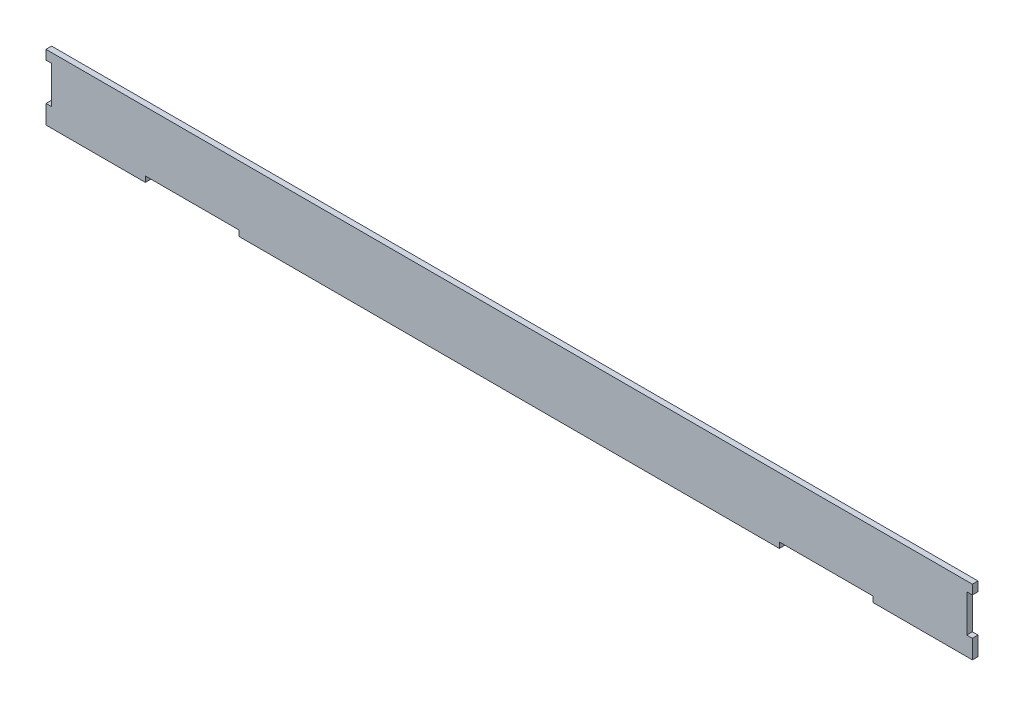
ISO-10303-21;
HEADER;
FILE_DESCRIPTION(('STEP AP214'),'2;1');
FILE_NAME('part.step','',(''),(''),'','','');
FILE_SCHEMA(('AUTOMOTIVE_DESIGN { 1 0 10303 214 1 1 1 1 }'));
ENDSEC;
DATA;
#1=APPLICATION_CONTEXT('core data for automotive mechanical design processes');
#2=APPLICATION_PROTOCOL_DEFINITION('international standard','automotive_design',2000,#1);
#3=PRODUCT_CONTEXT('',#1,'mechanical');
#4=PRODUCT('Part','Part','',(#3));
#5=PRODUCT_RELATED_PRODUCT_CATEGORY('part','',(#4));
#6=PRODUCT_DEFINITION_FORMATION('','',#4);
#7=PRODUCT_DEFINITION_CONTEXT('part definition',#1,'design');
#8=PRODUCT_DEFINITION('design','',#6,#7);
#9=PRODUCT_DEFINITION_SHAPE('','',#8);
#10=(LENGTH_UNIT() NAMED_UNIT(*) SI_UNIT(.MILLI.,.METRE.));
#11=(NAMED_UNIT(*) PLANE_ANGLE_UNIT() SI_UNIT($,.RADIAN.));
#12=(NAMED_UNIT(*) SI_UNIT($,.STERADIAN.) SOLID_ANGLE_UNIT());
#13=UNCERTAINTY_MEASURE_WITH_UNIT(LENGTH_MEASURE(1.E-05),#10,'distance_accuracy_value','');
#14=(GEOMETRIC_REPRESENTATION_CONTEXT(3) GLOBAL_UNCERTAINTY_ASSIGNED_CONTEXT((#13)) GLOBAL_UNIT_ASSIGNED_CONTEXT((#10,
#11,#12)) REPRESENTATION_CONTEXT('',''));
#15=CARTESIAN_POINT('',(0.,0.,0.));
#16=DIRECTION('',(0.,0.,1.));
#17=DIRECTION('',(1.,0.,0.));
#18=AXIS2_PLACEMENT_3D('',#15,#16,#17);
#19=CARTESIAN_POINT('',(0.,0.,3.));
#20=DIRECTION('',(1.,0.,0.));
#21=DIRECTION('',(0.,0.,-1.));
#22=AXIS2_PLACEMENT_3D('',#19,#20,#21);
#23=PLANE('',#22);
#24=DIRECTION('',(0.,-1.,0.));
#25=VECTOR('',#24,1.);
#26=CARTESIAN_POINT('',(0.,0.,0.));
#27=LINE('',#26,#25);
#28=CARTESIAN_POINT('',(0.,10.,0.));
#29=VERTEX_POINT('',#28);
#30=CARTESIAN_POINT('',(0.,0.,0.));
#31=VERTEX_POINT('',#30);
#32=EDGE_CURVE('E216',#29,#31,#27,.T.);
#33=ORIENTED_EDGE('',*,*,#32,.T.);
#34=DIRECTION('',(0.,0.,-1.));
#35=VECTOR('',#34,1.);
#36=CARTESIAN_POINT('',(0.,0.,3.));
#37=LINE('',#36,#35);
#38=CARTESIAN_POINT('',(0.,0.,3.));
#39=VERTEX_POINT('',#38);
#40=EDGE_CURVE('E11',#39,#31,#37,.T.);
#41=ORIENTED_EDGE('',*,*,#40,.F.);
#42=DIRECTION('',(0.,-1.,0.));
#43=VECTOR('',#42,1.);
#44=CARTESIAN_POINT('',(0.,0.,3.));
#45=LINE('',#44,#43);
#46=CARTESIAN_POINT('',(0.,10.,3.));
#47=VERTEX_POINT('',#46);
#48=EDGE_CURVE('E274',#47,#39,#45,.T.);
#49=ORIENTED_EDGE('',*,*,#48,.F.);
#50=DIRECTION('',(0.,0.,-1.));
#51=VECTOR('',#50,1.);
#52=CARTESIAN_POINT('',(0.,10.,3.));
#53=LINE('',#52,#51);
#54=EDGE_CURVE('E212',#47,#29,#53,.T.);
#55=ORIENTED_EDGE('',*,*,#54,.T.);
#56=EDGE_LOOP('',(#33,#41,#49,#55));
#57=FACE_BOUND('',#56,.T.);
#58=ADVANCED_FACE('F43',(#57),#23,.F.);
#59=CARTESIAN_POINT('',(0.,0.,3.));
#60=DIRECTION('',(0.,1.,0.));
#61=DIRECTION('',(0.,0.,1.));
#62=AXIS2_PLACEMENT_3D('',#59,#60,#61);
#63=PLANE('',#62);
#64=DIRECTION('',(1.,0.,0.));
#65=VECTOR('',#64,1.);
#66=CARTESIAN_POINT('',(0.,0.,0.));
#67=LINE('',#66,#65);
#68=CARTESIAN_POINT('',(53.,0.,0.));
#69=VERTEX_POINT('',#68);
#70=EDGE_CURVE('E220',#31,#69,#67,.T.);
#71=ORIENTED_EDGE('',*,*,#70,.T.);
#72=DIRECTION('',(0.,0.,-1.));
#73=VECTOR('',#72,1.);
#74=CARTESIAN_POINT('',(53.,0.,3.));
#75=LINE('',#74,#73);
#76=CARTESIAN_POINT('',(53.,0.,3.));
#77=VERTEX_POINT('',#76);
#78=EDGE_CURVE('E52',#77,#69,#75,.T.);
#79=ORIENTED_EDGE('',*,*,#78,.F.);
#80=DIRECTION('',(1.,0.,0.));
#81=VECTOR('',#80,1.);
#82=CARTESIAN_POINT('',(0.,0.,3.));
#83=LINE('',#82,#81);
#84=EDGE_CURVE('E139',#39,#77,#83,.T.);
#85=ORIENTED_EDGE('',*,*,#84,.F.);
#86=ORIENTED_EDGE('',*,*,#40,.T.);
#87=EDGE_LOOP('',(#71,#79,#85,#86));
#88=FACE_BOUND('',#87,.T.);
#89=ADVANCED_FACE('F424',(#88),#63,.F.);
#90=CARTESIAN_POINT('',(53.,0.,3.));
#91=DIRECTION('',(-1.,0.,0.));
#92=DIRECTION('',(0.,0.,1.));
#93=AXIS2_PLACEMENT_3D('',#90,#91,#92);
#94=PLANE('',#93);
#95=DIRECTION('',(0.,1.,0.));
#96=VECTOR('',#95,1.);
#97=CARTESIAN_POINT('',(53.,0.,0.));
#98=LINE('',#97,#96);
#99=CARTESIAN_POINT('',(53.,3.,0.));
#100=VERTEX_POINT('',#99);
#101=EDGE_CURVE('E223',#69,#100,#98,.T.);
#102=ORIENTED_EDGE('',*,*,#101,.T.);
#103=DIRECTION('',(0.,0.,-1.));
#104=VECTOR('',#103,1.);
#105=CARTESIAN_POINT('',(53.,3.,3.));
#106=LINE('',#105,#104);
#107=CARTESIAN_POINT('',(53.,3.,3.));
#108=VERTEX_POINT('',#107);
#109=EDGE_CURVE('E333',#108,#100,#106,.T.);
#110=ORIENTED_EDGE('',*,*,#109,.F.);
#111=DIRECTION('',(0.,1.,0.));
#112=VECTOR('',#111,1.);
#113=CARTESIAN_POINT('',(53.,0.,3.));
#114=LINE('',#113,#112);
#115=EDGE_CURVE('E343',#77,#108,#114,.T.);
#116=ORIENTED_EDGE('',*,*,#115,.F.);
#117=ORIENTED_EDGE('',*,*,#78,.T.);
#118=EDGE_LOOP('',(#102,#110,#116,#117));
#119=FACE_BOUND('',#118,.T.);
#120=ADVANCED_FACE('F341',(#119),#94,.F.);
#121=CARTESIAN_POINT('',(53.,3.,3.));
#122=DIRECTION('',(0.,1.,0.));
#123=DIRECTION('',(0.,0.,1.));
#124=AXIS2_PLACEMENT_3D('',#121,#122,#123);
#125=PLANE('',#124);
#126=DIRECTION('',(1.,0.,0.));
#127=VECTOR('',#126,1.);
#128=CARTESIAN_POINT('',(53.,3.,0.));
#129=LINE('',#128,#127);
#130=CARTESIAN_POINT('',(103.,3.,0.));
#131=VERTEX_POINT('',#130);
#132=EDGE_CURVE('E226',#100,#131,#129,.T.);
#133=ORIENTED_EDGE('',*,*,#132,.T.);
#134=DIRECTION('',(0.,0.,-1.));
#135=VECTOR('',#134,1.);
#136=CARTESIAN_POINT('',(103.,3.,3.));
#137=LINE('',#136,#135);
#138=CARTESIAN_POINT('',(103.,3.,3.));
#139=VERTEX_POINT('',#138);
#140=EDGE_CURVE('E329',#139,#131,#137,.T.);
#141=ORIENTED_EDGE('',*,*,#140,.F.);
#142=DIRECTION('',(1.,0.,0.));
#143=VECTOR('',#142,1.);
#144=CARTESIAN_POINT('',(53.,3.,3.));
#145=LINE('',#144,#143);
#146=EDGE_CURVE('E362',#108,#139,#145,.T.);
#147=ORIENTED_EDGE('',*,*,#146,.F.);
#148=ORIENTED_EDGE('',*,*,#109,.T.);
#149=EDGE_LOOP('',(#133,#141,#147,#148));
#150=FACE_BOUND('',#149,.T.);
#151=ADVANCED_FACE('F352',(#150),#125,.F.);
#152=CARTESIAN_POINT('',(103.,0.,3.));
#153=DIRECTION('',(1.,0.,0.));
#154=DIRECTION('',(0.,0.,-1.));
#155=AXIS2_PLACEMENT_3D('',#152,#153,#154);
#156=PLANE('',#155);
#157=DIRECTION('',(0.,-1.,0.));
#158=VECTOR('',#157,1.);
#159=CARTESIAN_POINT('',(103.,0.,0.));
#160=LINE('',#159,#158);
#161=CARTESIAN_POINT('',(103.,0.,0.));
#162=VERTEX_POINT('',#161);
#163=EDGE_CURVE('E229',#131,#162,#160,.T.);
#164=ORIENTED_EDGE('',*,*,#163,.T.);
#165=DIRECTION('',(0.,0.,-1.));
#166=VECTOR('',#165,1.);
#167=CARTESIAN_POINT('',(103.,0.,3.));
#168=LINE('',#167,#166);
#169=CARTESIAN_POINT('',(103.,0.,3.));
#170=VERTEX_POINT('',#169);
#171=EDGE_CURVE('E325',#170,#162,#168,.T.);
#172=ORIENTED_EDGE('',*,*,#171,.F.);
#173=DIRECTION('',(0.,-1.,0.));
#174=VECTOR('',#173,1.);
#175=CARTESIAN_POINT('',(103.,0.,3.));
#176=LINE('',#175,#174);
#177=EDGE_CURVE('E358',#139,#170,#176,.T.);
#178=ORIENTED_EDGE('',*,*,#177,.F.);
#179=ORIENTED_EDGE('',*,*,#140,.T.);
#180=EDGE_LOOP('',(#164,#172,#178,#179));
#181=FACE_BOUND('',#180,.T.);
#182=ADVANCED_FACE('F356',(#181),#156,.F.);
#183=CARTESIAN_POINT('',(103.,0.,3.));
#184=DIRECTION('',(0.,1.,0.));
#185=DIRECTION('',(0.,0.,1.));
#186=AXIS2_PLACEMENT_3D('',#183,#184,#185);
#187=PLANE('',#186);
#188=DIRECTION('',(1.,0.,0.));
#189=VECTOR('',#188,1.);
#190=CARTESIAN_POINT('',(103.,0.,0.));
#191=LINE('',#190,#189);
#192=CARTESIAN_POINT('',(391.4,0.,0.));
#193=VERTEX_POINT('',#192);
#194=EDGE_CURVE('E232',#162,#193,#191,.T.);
#195=ORIENTED_EDGE('',*,*,#194,.T.);
#196=DIRECTION('',(0.,0.,-1.));
#197=VECTOR('',#196,1.);
#198=CARTESIAN_POINT('',(391.4,0.,3.));
#199=LINE('',#198,#197);
#200=CARTESIAN_POINT('',(391.4,0.,3.));
#201=VERTEX_POINT('',#200);
#202=EDGE_CURVE('E321',#201,#193,#199,.T.);
#203=ORIENTED_EDGE('',*,*,#202,.F.);
#204=DIRECTION('',(1.,0.,0.));
#205=VECTOR('',#204,1.);
#206=CARTESIAN_POINT('',(103.,0.,3.));
#207=LINE('',#206,#205);
#208=EDGE_CURVE('E361',#170,#201,#207,.T.);
#209=ORIENTED_EDGE('',*,*,#208,.F.);
#210=ORIENTED_EDGE('',*,*,#171,.T.);
#211=EDGE_LOOP('',(#195,#203,#209,#210));
#212=FACE_BOUND('',#211,.T.);
#213=ADVANCED_FACE('F437',(#212),#187,.F.);
#214=CARTESIAN_POINT('',(391.4,0.,3.));
#215=DIRECTION('',(-1.,0.,0.));
#216=DIRECTION('',(0.,0.,1.));
#217=AXIS2_PLACEMENT_3D('',#214,#215,#216);
#218=PLANE('',#217);
#219=DIRECTION('',(0.,1.,0.));
#220=VECTOR('',#219,1.);
#221=CARTESIAN_POINT('',(391.4,0.,0.));
#222=LINE('',#221,#220);
#223=CARTESIAN_POINT('',(391.4,3.,0.));
#224=VERTEX_POINT('',#223);
#225=EDGE_CURVE('E235',#193,#224,#222,.T.);
#226=ORIENTED_EDGE('',*,*,#225,.T.);
#227=DIRECTION('',(0.,0.,-1.));
#228=VECTOR('',#227,1.);
#229=CARTESIAN_POINT('',(391.4,3.,3.));
#230=LINE('',#229,#228);
#231=CARTESIAN_POINT('',(391.4,3.,3.));
#232=VERTEX_POINT('',#231);
#233=EDGE_CURVE('E317',#232,#224,#230,.T.);
#234=ORIENTED_EDGE('',*,*,#233,.F.);
#235=DIRECTION('',(0.,1.,0.));
#236=VECTOR('',#235,1.);
#237=CARTESIAN_POINT('',(391.4,0.,3.));
#238=LINE('',#237,#236);
#239=EDGE_CURVE('E366',#201,#232,#238,.T.);
#240=ORIENTED_EDGE('',*,*,#239,.F.);
#241=ORIENTED_EDGE('',*,*,#202,.T.);
#242=EDGE_LOOP('',(#226,#234,#240,#241));
#243=FACE_BOUND('',#242,.T.);
#244=ADVANCED_FACE('F440',(#243),#218,.F.);
#245=CARTESIAN_POINT('',(391.4,3.,3.));
#246=DIRECTION('',(0.,1.,0.));
#247=DIRECTION('',(0.,0.,1.));
#248=AXIS2_PLACEMENT_3D('',#245,#246,#247);
#249=PLANE('',#248);
#250=DIRECTION('',(1.,0.,0.));
#251=VECTOR('',#250,1.);
#252=CARTESIAN_POINT('',(391.4,3.,0.));
#253=LINE('',#252,#251);
#254=CARTESIAN_POINT('',(441.4,3.,0.));
#255=VERTEX_POINT('',#254);
#256=EDGE_CURVE('E238',#224,#255,#253,.T.);
#257=ORIENTED_EDGE('',*,*,#256,.T.);
#258=DIRECTION('',(0.,0.,-1.));
#259=VECTOR('',#258,1.);
#260=CARTESIAN_POINT('',(441.4,3.,3.));
#261=LINE('',#260,#259);
#262=CARTESIAN_POINT('',(441.4,3.,3.));
#263=VERTEX_POINT('',#262);
#264=EDGE_CURVE('E313',#263,#255,#261,.T.);
#265=ORIENTED_EDGE('',*,*,#264,.F.);
#266=DIRECTION('',(1.,0.,0.));
#267=VECTOR('',#266,1.);
#268=CARTESIAN_POINT('',(391.4,3.,3.));
#269=LINE('',#268,#267);
#270=EDGE_CURVE('E373',#232,#263,#269,.T.);
#271=ORIENTED_EDGE('',*,*,#270,.F.);
#272=ORIENTED_EDGE('',*,*,#233,.T.);
#273=EDGE_LOOP('',(#257,#265,#271,#272));
#274=FACE_BOUND('',#273,.T.);
#275=ADVANCED_FACE('F444',(#274),#249,.F.);
#276=CARTESIAN_POINT('',(441.4,0.,3.));
#277=DIRECTION('',(1.,0.,0.));
#278=DIRECTION('',(0.,0.,-1.));
#279=AXIS2_PLACEMENT_3D('',#276,#277,#278);
#280=PLANE('',#279);
#281=DIRECTION('',(0.,-1.,0.));
#282=VECTOR('',#281,1.);
#283=CARTESIAN_POINT('',(441.4,0.,0.));
#284=LINE('',#283,#282);
#285=CARTESIAN_POINT('',(441.4,0.,0.));
#286=VERTEX_POINT('',#285);
#287=EDGE_CURVE('E241',#255,#286,#284,.T.);
#288=ORIENTED_EDGE('',*,*,#287,.T.);
#289=DIRECTION('',(0.,0.,-1.));
#290=VECTOR('',#289,1.);
#291=CARTESIAN_POINT('',(441.4,0.,3.));
#292=LINE('',#291,#290);
#293=CARTESIAN_POINT('',(441.4,0.,3.));
#294=VERTEX_POINT('',#293);
#295=EDGE_CURVE('E309',#294,#286,#292,.T.);
#296=ORIENTED_EDGE('',*,*,#295,.F.);
#297=DIRECTION('',(0.,-1.,0.));
#298=VECTOR('',#297,1.);
#299=CARTESIAN_POINT('',(441.4,0.,3.));
#300=LINE('',#299,#298);
#301=EDGE_CURVE('E376',#263,#294,#300,.T.);
#302=ORIENTED_EDGE('',*,*,#301,.F.);
#303=ORIENTED_EDGE('',*,*,#264,.T.);
#304=EDGE_LOOP('',(#288,#296,#302,#303));
#305=FACE_BOUND('',#304,.T.);
#306=ADVANCED_FACE('F448',(#305),#280,.F.);
#307=CARTESIAN_POINT('',(441.4,0.,3.));
#308=DIRECTION('',(0.,1.,0.));
#309=DIRECTION('',(-1.,0.,0.));
#310=AXIS2_PLACEMENT_3D('',#307,#308,#309);
#311=PLANE('',#310);
#312=DIRECTION('',(1.,0.,0.));
#313=VECTOR('',#312,1.);
#314=CARTESIAN_POINT('',(441.4,0.,0.));
#315=LINE('',#314,#313);
#316=CARTESIAN_POINT('',(494.4,0.,0.));
#317=VERTEX_POINT('',#316);
#318=EDGE_CURVE('E244',#286,#317,#315,.T.);
#319=ORIENTED_EDGE('',*,*,#318,.T.);
#320=DIRECTION('',(0.,0.,-1.));
#321=VECTOR('',#320,1.);
#322=CARTESIAN_POINT('',(494.4,0.,3.));
#323=LINE('',#322,#321);
#324=CARTESIAN_POINT('',(494.4,0.,3.));
#325=VERTEX_POINT('',#324);
#326=EDGE_CURVE('E305',#325,#317,#323,.T.);
#327=ORIENTED_EDGE('',*,*,#326,.F.);
#328=DIRECTION('',(1.,0.,0.));
#329=VECTOR('',#328,1.);
#330=CARTESIAN_POINT('',(441.4,0.,3.));
#331=LINE('',#330,#329);
#332=EDGE_CURVE('E379',#294,#325,#331,.T.);
#333=ORIENTED_EDGE('',*,*,#332,.F.);
#334=ORIENTED_EDGE('',*,*,#295,.T.);
#335=EDGE_LOOP('',(#319,#327,#333,#334));
#336=FACE_BOUND('',#335,.T.);
#337=ADVANCED_FACE('F452',(#336),#311,.F.);
#338=CARTESIAN_POINT('',(494.4,0.,3.));
#339=DIRECTION('',(-1.,0.,0.));
#340=DIRECTION('',(0.,-1.,0.));
#341=AXIS2_PLACEMENT_3D('',#338,#339,#340);
#342=PLANE('',#341);
#343=DIRECTION('',(0.,1.,0.));
#344=VECTOR('',#343,1.);
#345=CARTESIAN_POINT('',(494.4,0.,0.));
#346=LINE('',#345,#344);
#347=CARTESIAN_POINT('',(494.4,10.0000000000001,0.));
#348=VERTEX_POINT('',#347);
#349=EDGE_CURVE('E247',#317,#348,#346,.T.);
#350=ORIENTED_EDGE('',*,*,#349,.T.);
#351=DIRECTION('',(0.,0.,-1.));
#352=VECTOR('',#351,1.);
#353=CARTESIAN_POINT('',(494.4,10.0000000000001,3.));
#354=LINE('',#353,#352);
#355=CARTESIAN_POINT('',(494.4,10.0000000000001,3.));
#356=VERTEX_POINT('',#355);
#357=EDGE_CURVE('E301',#356,#348,#354,.T.);
#358=ORIENTED_EDGE('',*,*,#357,.F.);
#359=DIRECTION('',(0.,1.,0.));
#360=VECTOR('',#359,1.);
#361=CARTESIAN_POINT('',(494.4,0.,3.));
#362=LINE('',#361,#360);
#363=EDGE_CURVE('E382',#325,#356,#362,.T.);
#364=ORIENTED_EDGE('',*,*,#363,.F.);
#365=ORIENTED_EDGE('',*,*,#326,.T.);
#366=EDGE_LOOP('',(#350,#358,#364,#365));
#367=FACE_BOUND('',#366,.T.);
#368=ADVANCED_FACE('F456',(#367),#342,.F.);
#369=CARTESIAN_POINT('',(494.4,10.0000000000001,3.));
#370=DIRECTION('',(0.,-1.,0.));
#371=DIRECTION('',(1.,0.,0.));
#372=AXIS2_PLACEMENT_3D('',#369,#370,#371);
#373=PLANE('',#372);
#374=DIRECTION('',(-1.,0.,0.));
#375=VECTOR('',#374,1.);
#376=CARTESIAN_POINT('',(494.4,10.0000000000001,0.));
#377=LINE('',#376,#375);
#378=CARTESIAN_POINT('',(491.4,10.0000000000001,0.));
#379=VERTEX_POINT('',#378);
#380=EDGE_CURVE('E250',#348,#379,#377,.T.);
#381=ORIENTED_EDGE('',*,*,#380,.T.);
#382=DIRECTION('',(0.,0.,-1.));
#383=VECTOR('',#382,1.);
#384=CARTESIAN_POINT('',(491.4,10.0000000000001,3.));
#385=LINE('',#384,#383);
#386=CARTESIAN_POINT('',(491.4,10.0000000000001,3.));
#387=VERTEX_POINT('',#386);
#388=EDGE_CURVE('E297',#387,#379,#385,.T.);
#389=ORIENTED_EDGE('',*,*,#388,.F.);
#390=DIRECTION('',(-1.,0.,0.));
#391=VECTOR('',#390,1.);
#392=CARTESIAN_POINT('',(494.4,10.0000000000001,3.));
#393=LINE('',#392,#391);
#394=EDGE_CURVE('E385',#356,#387,#393,.T.);
#395=ORIENTED_EDGE('',*,*,#394,.F.);
#396=ORIENTED_EDGE('',*,*,#357,.T.);
#397=EDGE_LOOP('',(#381,#389,#395,#396));
#398=FACE_BOUND('',#397,.T.);
#399=ADVANCED_FACE('F460',(#398),#373,.F.);
#400=CARTESIAN_POINT('',(491.4,10.0000000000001,3.));
#401=DIRECTION('',(-1.,0.,0.));
#402=DIRECTION('',(0.,0.,1.));
#403=AXIS2_PLACEMENT_3D('',#400,#401,#402);
#404=PLANE('',#403);
#405=DIRECTION('',(0.,1.,0.));
#406=VECTOR('',#405,1.);
#407=CARTESIAN_POINT('',(491.4,10.0000000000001,0.));
#408=LINE('',#407,#406);
#409=CARTESIAN_POINT('',(491.4,30.0000000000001,0.));
#410=VERTEX_POINT('',#409);
#411=EDGE_CURVE('E253',#379,#410,#408,.T.);
#412=ORIENTED_EDGE('',*,*,#411,.T.);
#413=DIRECTION('',(0.,0.,-1.));
#414=VECTOR('',#413,1.);
#415=CARTESIAN_POINT('',(491.4,30.0000000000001,3.));
#416=LINE('',#415,#414);
#417=CARTESIAN_POINT('',(491.4,30.0000000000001,3.));
#418=VERTEX_POINT('',#417);
#419=EDGE_CURVE('E293',#418,#410,#416,.T.);
#420=ORIENTED_EDGE('',*,*,#419,.F.);
#421=DIRECTION('',(0.,1.,0.));
#422=VECTOR('',#421,1.);
#423=CARTESIAN_POINT('',(491.4,10.0000000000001,3.));
#424=LINE('',#423,#422);
#425=EDGE_CURVE('E388',#387,#418,#424,.T.);
#426=ORIENTED_EDGE('',*,*,#425,.F.);
#427=ORIENTED_EDGE('',*,*,#388,.T.);
#428=EDGE_LOOP('',(#412,#420,#426,#427));
#429=FACE_BOUND('',#428,.T.);
#430=ADVANCED_FACE('F464',(#429),#404,.F.);
#431=CARTESIAN_POINT('',(494.4,30.0000000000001,3.));
#432=DIRECTION('',(0.,1.,0.));
#433=DIRECTION('',(0.,0.,1.));
#434=AXIS2_PLACEMENT_3D('',#431,#432,#433);
#435=PLANE('',#434);
#436=DIRECTION('',(1.,0.,0.));
#437=VECTOR('',#436,1.);
#438=CARTESIAN_POINT('',(494.4,30.0000000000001,0.));
#439=LINE('',#438,#437);
#440=CARTESIAN_POINT('',(494.4,30.0000000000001,0.));
#441=VERTEX_POINT('',#440);
#442=EDGE_CURVE('E256',#410,#441,#439,.T.);
#443=ORIENTED_EDGE('',*,*,#442,.T.);
#444=DIRECTION('',(0.,0.,-1.));
#445=VECTOR('',#444,1.);
#446=CARTESIAN_POINT('',(494.4,30.0000000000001,3.));
#447=LINE('',#446,#445);
#448=CARTESIAN_POINT('',(494.4,30.0000000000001,3.));
#449=VERTEX_POINT('',#448);
#450=EDGE_CURVE('E289',#449,#441,#447,.T.);
#451=ORIENTED_EDGE('',*,*,#450,.F.);
#452=DIRECTION('',(1.,0.,0.));
#453=VECTOR('',#452,1.);
#454=CARTESIAN_POINT('',(494.4,30.0000000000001,3.));
#455=LINE('',#454,#453);
#456=EDGE_CURVE('E391',#418,#449,#455,.T.);
#457=ORIENTED_EDGE('',*,*,#456,.F.);
#458=ORIENTED_EDGE('',*,*,#419,.T.);
#459=EDGE_LOOP('',(#443,#451,#457,#458));
#460=FACE_BOUND('',#459,.T.);
#461=ADVANCED_FACE('F468',(#460),#435,.F.);
#462=CARTESIAN_POINT('',(494.4,30.0000000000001,3.));
#463=DIRECTION('',(-1.,0.,0.));
#464=DIRECTION('',(0.,0.,1.));
#465=AXIS2_PLACEMENT_3D('',#462,#463,#464);
#466=PLANE('',#465);
#467=DIRECTION('',(0.,1.,0.));
#468=VECTOR('',#467,1.);
#469=CARTESIAN_POINT('',(494.4,30.0000000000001,0.));
#470=LINE('',#469,#468);
#471=CARTESIAN_POINT('',(494.4,35.0000000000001,0.));
#472=VERTEX_POINT('',#471);
#473=EDGE_CURVE('E259',#441,#472,#470,.T.);
#474=ORIENTED_EDGE('',*,*,#473,.T.);
#475=DIRECTION('',(0.,0.,-1.));
#476=VECTOR('',#475,1.);
#477=CARTESIAN_POINT('',(494.4,35.0000000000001,3.));
#478=LINE('',#477,#476);
#479=CARTESIAN_POINT('',(494.4,35.0000000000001,3.));
#480=VERTEX_POINT('',#479);
#481=EDGE_CURVE('E285',#480,#472,#478,.T.);
#482=ORIENTED_EDGE('',*,*,#481,.F.);
#483=DIRECTION('',(0.,1.,0.));
#484=VECTOR('',#483,1.);
#485=CARTESIAN_POINT('',(494.4,30.0000000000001,3.));
#486=LINE('',#485,#484);
#487=EDGE_CURVE('E394',#449,#480,#486,.T.);
#488=ORIENTED_EDGE('',*,*,#487,.F.);
#489=ORIENTED_EDGE('',*,*,#450,.T.);
#490=EDGE_LOOP('',(#474,#482,#488,#489));
#491=FACE_BOUND('',#490,.T.);
#492=ADVANCED_FACE('F472',(#491),#466,.F.);
#493=CARTESIAN_POINT('',(0.,35.,3.));
#494=DIRECTION('',(0.,-1.,0.));
#495=DIRECTION('',(1.,0.,0.));
#496=AXIS2_PLACEMENT_3D('',#493,#494,#495);
#497=PLANE('',#496);
#498=DIRECTION('',(-1.,0.,0.));
#499=VECTOR('',#498,1.);
#500=CARTESIAN_POINT('',(0.,35.,0.));
#501=LINE('',#500,#499);
#502=CARTESIAN_POINT('',(0.,35.,0.));
#503=VERTEX_POINT('',#502);
#504=EDGE_CURVE('E262',#472,#503,#501,.T.);
#505=ORIENTED_EDGE('',*,*,#504,.T.);
#506=DIRECTION('',(0.,0.,-1.));
#507=VECTOR('',#506,1.);
#508=CARTESIAN_POINT('',(0.,35.,3.));
#509=LINE('',#508,#507);
#510=CARTESIAN_POINT('',(0.,35.,3.));
#511=VERTEX_POINT('',#510);
#512=EDGE_CURVE('E281',#511,#503,#509,.T.);
#513=ORIENTED_EDGE('',*,*,#512,.F.);
#514=DIRECTION('',(-1.,0.,0.));
#515=VECTOR('',#514,1.);
#516=CARTESIAN_POINT('',(0.,35.,3.));
#517=LINE('',#516,#515);
#518=EDGE_CURVE('E397',#480,#511,#517,.T.);
#519=ORIENTED_EDGE('',*,*,#518,.F.);
#520=ORIENTED_EDGE('',*,*,#481,.T.);
#521=EDGE_LOOP('',(#505,#513,#519,#520));
#522=FACE_BOUND('',#521,.T.);
#523=ADVANCED_FACE('F405',(#522),#497,.F.);
#524=CARTESIAN_POINT('',(0.,30.,3.));
#525=DIRECTION('',(1.,0.,0.));
#526=DIRECTION('',(0.,0.,-1.));
#527=AXIS2_PLACEMENT_3D('',#524,#525,#526);
#528=PLANE('',#527);
#529=DIRECTION('',(0.,-1.,0.));
#530=VECTOR('',#529,1.);
#531=CARTESIAN_POINT('',(0.,30.,0.));
#532=LINE('',#531,#530);
#533=CARTESIAN_POINT('',(0.,30.,0.));
#534=VERTEX_POINT('',#533);
#535=EDGE_CURVE('E265',#503,#534,#532,.T.);
#536=ORIENTED_EDGE('',*,*,#535,.T.);
#537=DIRECTION('',(0.,0.,-1.));
#538=VECTOR('',#537,1.);
#539=CARTESIAN_POINT('',(0.,30.,3.));
#540=LINE('',#539,#538);
#541=CARTESIAN_POINT('',(0.,30.,3.));
#542=VERTEX_POINT('',#541);
#543=EDGE_CURVE('E205',#542,#534,#540,.T.);
#544=ORIENTED_EDGE('',*,*,#543,.F.);
#545=DIRECTION('',(0.,-1.,0.));
#546=VECTOR('',#545,1.);
#547=CARTESIAN_POINT('',(0.,30.,3.));
#548=LINE('',#547,#546);
#549=EDGE_CURVE('E194',#511,#542,#548,.T.);
#550=ORIENTED_EDGE('',*,*,#549,.F.);
#551=ORIENTED_EDGE('',*,*,#512,.T.);
#552=EDGE_LOOP('',(#536,#544,#550,#551));
#553=FACE_BOUND('',#552,.T.);
#554=ADVANCED_FACE('F409',(#553),#528,.F.);
#555=CARTESIAN_POINT('',(0.,30.,3.));
#556=DIRECTION('',(0.,1.,0.));
#557=DIRECTION('',(0.,0.,1.));
#558=AXIS2_PLACEMENT_3D('',#555,#556,#557);
#559=PLANE('',#558);
#560=DIRECTION('',(1.,0.,0.));
#561=VECTOR('',#560,1.);
#562=CARTESIAN_POINT('',(0.,30.,0.));
#563=LINE('',#562,#561);
#564=CARTESIAN_POINT('',(3.,30.,0.));
#565=VERTEX_POINT('',#564);
#566=EDGE_CURVE('E203',#534,#565,#563,.T.);
#567=ORIENTED_EDGE('',*,*,#566,.T.);
#568=DIRECTION('',(0.,0.,-1.));
#569=VECTOR('',#568,1.);
#570=CARTESIAN_POINT('',(3.,30.,3.));
#571=LINE('',#570,#569);
#572=CARTESIAN_POINT('',(3.,30.,3.));
#573=VERTEX_POINT('',#572);
#574=EDGE_CURVE('E200',#573,#565,#571,.T.);
#575=ORIENTED_EDGE('',*,*,#574,.F.);
#576=DIRECTION('',(1.,0.,0.));
#577=VECTOR('',#576,1.);
#578=CARTESIAN_POINT('',(0.,30.,3.));
#579=LINE('',#578,#577);
#580=EDGE_CURVE('E188',#542,#573,#579,.T.);
#581=ORIENTED_EDGE('',*,*,#580,.F.);
#582=ORIENTED_EDGE('',*,*,#543,.T.);
#583=EDGE_LOOP('',(#567,#575,#581,#582));
#584=FACE_BOUND('',#583,.T.);
#585=ADVANCED_FACE('F201',(#584),#559,.F.);
#586=CARTESIAN_POINT('',(3.,10.,3.));
#587=DIRECTION('',(1.,0.,0.));
#588=DIRECTION('',(0.,0.,-1.));
#589=AXIS2_PLACEMENT_3D('',#586,#587,#588);
#590=PLANE('',#589);
#591=DIRECTION('',(0.,-1.,0.));
#592=VECTOR('',#591,1.);
#593=CARTESIAN_POINT('',(3.,10.,0.));
#594=LINE('',#593,#592);
#595=CARTESIAN_POINT('',(3.,10.,0.));
#596=VERTEX_POINT('',#595);
#597=EDGE_CURVE('E125',#565,#596,#594,.T.);
#598=ORIENTED_EDGE('',*,*,#597,.T.);
#599=DIRECTION('',(0.,0.,-1.));
#600=VECTOR('',#599,1.);
#601=CARTESIAN_POINT('',(3.,10.,3.));
#602=LINE('',#601,#600);
#603=CARTESIAN_POINT('',(3.,10.,3.));
#604=VERTEX_POINT('',#603);
#605=EDGE_CURVE('E206',#604,#596,#602,.T.);
#606=ORIENTED_EDGE('',*,*,#605,.F.);
#607=DIRECTION('',(0.,-1.,0.));
#608=VECTOR('',#607,1.);
#609=CARTESIAN_POINT('',(3.,10.,3.));
#610=LINE('',#609,#608);
#611=EDGE_CURVE('E192',#573,#604,#610,.T.);
#612=ORIENTED_EDGE('',*,*,#611,.F.);
#613=ORIENTED_EDGE('',*,*,#574,.T.);
#614=EDGE_LOOP('',(#598,#606,#612,#613));
#615=FACE_BOUND('',#614,.T.);
#616=ADVANCED_FACE('F208',(#615),#590,.F.);
#617=CARTESIAN_POINT('',(0.,10.,3.));
#618=DIRECTION('',(0.,-1.,0.));
#619=DIRECTION('',(0.,0.,-1.));
#620=AXIS2_PLACEMENT_3D('',#617,#618,#619);
#621=PLANE('',#620);
#622=DIRECTION('',(-1.,0.,0.));
#623=VECTOR('',#622,1.);
#624=CARTESIAN_POINT('',(0.,10.,0.));
#625=LINE('',#624,#623);
#626=EDGE_CURVE('E131',#596,#29,#625,.T.);
#627=ORIENTED_EDGE('',*,*,#626,.T.);
#628=ORIENTED_EDGE('',*,*,#54,.F.);
#629=DIRECTION('',(-1.,0.,0.));
#630=VECTOR('',#629,1.);
#631=CARTESIAN_POINT('',(0.,10.,3.));
#632=LINE('',#631,#630);
#633=EDGE_CURVE('E60',#604,#47,#632,.T.);
#634=ORIENTED_EDGE('',*,*,#633,.F.);
#635=ORIENTED_EDGE('',*,*,#605,.T.);
#636=EDGE_LOOP('',(#627,#628,#634,#635));
#637=FACE_BOUND('',#636,.T.);
#638=ADVANCED_FACE('F413',(#637),#621,.F.);
#639=CARTESIAN_POINT('',(0.,0.,3.));
#640=DIRECTION('',(0.,0.,-1.));
#641=DIRECTION('',(-1.,0.,0.));
#642=AXIS2_PLACEMENT_3D('',#639,#640,#641);
#643=PLANE('',#642);
#644=ORIENTED_EDGE('',*,*,#48,.T.);
#645=ORIENTED_EDGE('',*,*,#84,.T.);
#646=ORIENTED_EDGE('',*,*,#115,.T.);
#647=ORIENTED_EDGE('',*,*,#146,.T.);
#648=ORIENTED_EDGE('',*,*,#177,.T.);
#649=ORIENTED_EDGE('',*,*,#208,.T.);
#650=ORIENTED_EDGE('',*,*,#239,.T.);
#651=ORIENTED_EDGE('',*,*,#270,.T.);
#652=ORIENTED_EDGE('',*,*,#301,.T.);
#653=ORIENTED_EDGE('',*,*,#332,.T.);
#654=ORIENTED_EDGE('',*,*,#363,.T.);
#655=ORIENTED_EDGE('',*,*,#394,.T.);
#656=ORIENTED_EDGE('',*,*,#425,.T.);
#657=ORIENTED_EDGE('',*,*,#456,.T.);
#658=ORIENTED_EDGE('',*,*,#487,.T.);
#659=ORIENTED_EDGE('',*,*,#518,.T.);
#660=ORIENTED_EDGE('',*,*,#549,.T.);
#661=ORIENTED_EDGE('',*,*,#580,.T.);
#662=ORIENTED_EDGE('',*,*,#611,.T.);
#663=ORIENTED_EDGE('',*,*,#633,.T.);
#664=EDGE_LOOP('',(#644,#645,#646,#647,#648,#649,#650,#651,#652,#653,#654,#655,#656,#657,#658,
#659,#660,#661,#662,#663));
#665=FACE_BOUND('',#664,.T.);
#666=ADVANCED_FACE('F190',(#665),#643,.F.);
#667=CARTESIAN_POINT('',(0.,0.,0.));
#668=DIRECTION('',(0.,0.,-1.));
#669=DIRECTION('',(-1.,0.,0.));
#670=AXIS2_PLACEMENT_3D('',#667,#668,#669);
#671=PLANE('',#670);
#672=ORIENTED_EDGE('',*,*,#32,.F.);
#673=ORIENTED_EDGE('',*,*,#626,.F.);
#674=ORIENTED_EDGE('',*,*,#597,.F.);
#675=ORIENTED_EDGE('',*,*,#566,.F.);
#676=ORIENTED_EDGE('',*,*,#535,.F.);
#677=ORIENTED_EDGE('',*,*,#504,.F.);
#678=ORIENTED_EDGE('',*,*,#473,.F.);
#679=ORIENTED_EDGE('',*,*,#442,.F.);
#680=ORIENTED_EDGE('',*,*,#411,.F.);
#681=ORIENTED_EDGE('',*,*,#380,.F.);
#682=ORIENTED_EDGE('',*,*,#349,.F.);
#683=ORIENTED_EDGE('',*,*,#318,.F.);
#684=ORIENTED_EDGE('',*,*,#287,.F.);
#685=ORIENTED_EDGE('',*,*,#256,.F.);
#686=ORIENTED_EDGE('',*,*,#225,.F.);
#687=ORIENTED_EDGE('',*,*,#194,.F.);
#688=ORIENTED_EDGE('',*,*,#163,.F.);
#689=ORIENTED_EDGE('',*,*,#132,.F.);
#690=ORIENTED_EDGE('',*,*,#101,.F.);
#691=ORIENTED_EDGE('',*,*,#70,.F.);
#692=EDGE_LOOP('',(#672,#673,#674,#675,#676,#677,#678,#679,#680,#681,#682,#683,#684,#685,#686,
#687,#688,#689,#690,#691));
#693=FACE_BOUND('',#692,.T.);
#694=ADVANCED_FACE('F347',(#693),#671,.T.);
#695=CLOSED_SHELL('',(#58,#89,#120,#151,#182,#213,#244,#275,#306,#337,#368,#399,#430,#461,#492,
#523,#554,#585,#616,#638,#666,#694));
#696=MANIFOLD_SOLID_BREP('B2',#695);
#697=ADVANCED_BREP_SHAPE_REPRESENTATION('',(#18,#696),#14);
#698=SHAPE_DEFINITION_REPRESENTATION(#9,#697);
ENDSEC;
END-ISO-10303-21;
